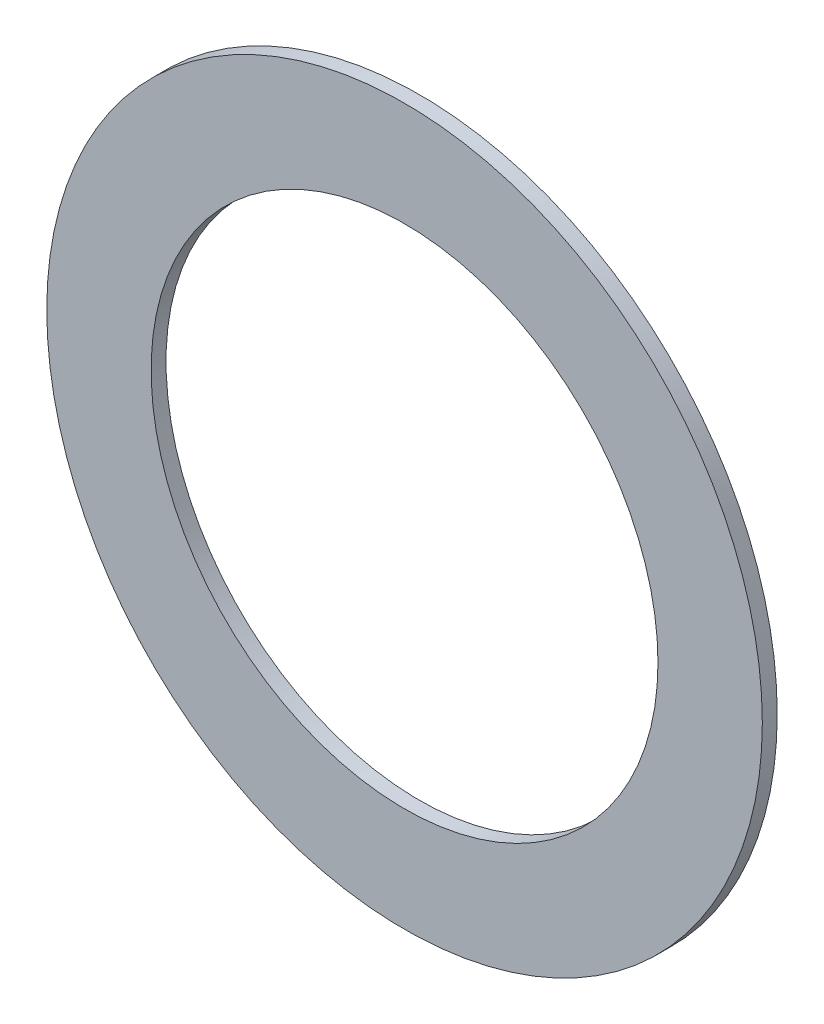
from build123d import *

# Parameters (mm, degrees)
ESQUISSE1_R      = 12
ESQUISSE1_R_2    = 8.5
EXTRUSION1_DEPTH = 0.5


with BuildPart() as part:
    # Esquisse1 → Extrusion1 (new body)
    with BuildSketch(Plane.XY):
        Circle(ESQUISSE1_R)
        Circle(ESQUISSE1_R_2, mode=Mode.SUBTRACT)
    extrude(amount=EXTRUSION1_DEPTH)


solid = part.part
